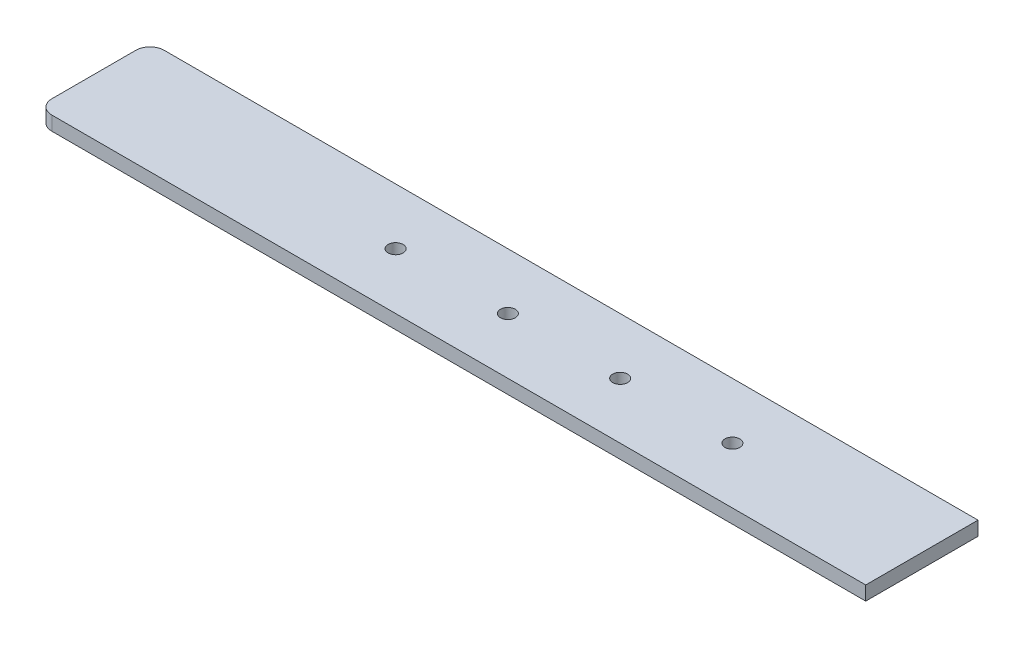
ISO-10303-21;
HEADER;
FILE_DESCRIPTION(('STEP AP214'),'2;1');
FILE_NAME('part.step','',(''),(''),'','','');
FILE_SCHEMA(('AUTOMOTIVE_DESIGN { 1 0 10303 214 1 1 1 1 }'));
ENDSEC;
DATA;
#1=APPLICATION_CONTEXT('core data for automotive mechanical design processes');
#2=APPLICATION_PROTOCOL_DEFINITION('international standard','automotive_design',2000,#1);
#3=PRODUCT_CONTEXT('',#1,'mechanical');
#4=PRODUCT('Part','Part','',(#3));
#5=PRODUCT_RELATED_PRODUCT_CATEGORY('part','',(#4));
#6=PRODUCT_DEFINITION_FORMATION('','',#4);
#7=PRODUCT_DEFINITION_CONTEXT('part definition',#1,'design');
#8=PRODUCT_DEFINITION('design','',#6,#7);
#9=PRODUCT_DEFINITION_SHAPE('','',#8);
#10=(LENGTH_UNIT() NAMED_UNIT(*) SI_UNIT(.MILLI.,.METRE.));
#11=(NAMED_UNIT(*) PLANE_ANGLE_UNIT() SI_UNIT($,.RADIAN.));
#12=(NAMED_UNIT(*) SI_UNIT($,.STERADIAN.) SOLID_ANGLE_UNIT());
#13=UNCERTAINTY_MEASURE_WITH_UNIT(LENGTH_MEASURE(1.E-05),#10,'distance_accuracy_value','');
#14=(GEOMETRIC_REPRESENTATION_CONTEXT(3) GLOBAL_UNCERTAINTY_ASSIGNED_CONTEXT((#13)) GLOBAL_UNIT_ASSIGNED_CONTEXT((#10,
#11,#12)) REPRESENTATION_CONTEXT('',''));
#15=CARTESIAN_POINT('',(0.,0.,0.));
#16=DIRECTION('',(0.,0.,1.));
#17=DIRECTION('',(1.,0.,0.));
#18=AXIS2_PLACEMENT_3D('',#15,#16,#17);
#19=CARTESIAN_POINT('',(-187.325,-6.35000000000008,25.4000000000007));
#20=DIRECTION('',(-1.00000000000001,0.,0.));
#21=DIRECTION('',(0.,0.,1.));
#22=AXIS2_PLACEMENT_3D('',#19,#20,#21);
#23=PLANE('',#22);
#24=DIRECTION('',(0.,0.,1.));
#25=VECTOR('',#24,1.);
#26=CARTESIAN_POINT('',(-187.325,0.,25.4));
#27=LINE('',#26,#25);
#28=CARTESIAN_POINT('',(-187.325,0.,-19.0499999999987));
#29=VERTEX_POINT('',#28);
#30=CARTESIAN_POINT('',(-187.325000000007,2.88657986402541E-12,19.05));
#31=VERTEX_POINT('',#30);
#32=EDGE_CURVE('E119',#29,#31,#27,.T.);
#33=ORIENTED_EDGE('',*,*,#32,.F.);
#34=DIRECTION('',(0.,1.,0.));
#35=VECTOR('',#34,1.);
#36=CARTESIAN_POINT('',(-187.325,-6.34999999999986,-19.0499999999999));
#37=LINE('',#36,#35);
#38=CARTESIAN_POINT('',(-187.325,-6.34999999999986,-19.0499999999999));
#39=VERTEX_POINT('',#38);
#40=EDGE_CURVE('E140',#29,#39,#37,.F.);
#41=ORIENTED_EDGE('',*,*,#40,.T.);
#42=DIRECTION('',(0.,0.,1.));
#43=VECTOR('',#42,1.);
#44=CARTESIAN_POINT('',(-187.325,-6.35000000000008,25.4000000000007));
#45=LINE('',#44,#43);
#46=CARTESIAN_POINT('',(-187.325000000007,-6.34999999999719,19.0500000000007));
#47=VERTEX_POINT('',#46);
#48=EDGE_CURVE('E102',#39,#47,#45,.T.);
#49=ORIENTED_EDGE('',*,*,#48,.T.);
#50=DIRECTION('',(0.,1.,0.));
#51=VECTOR('',#50,1.);
#52=CARTESIAN_POINT('',(-187.325000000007,-6.34999999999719,19.0500000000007));
#53=LINE('',#52,#51);
#54=EDGE_CURVE('E137',#47,#31,#53,.T.);
#55=ORIENTED_EDGE('',*,*,#54,.T.);
#56=EDGE_LOOP('',(#33,#41,#49,#55));
#57=FACE_BOUND('',#56,.T.);
#58=ADVANCED_FACE('F44',(#57),#23,.T.);
#59=CARTESIAN_POINT('',(-187.325,-6.35000000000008,-25.4));
#60=DIRECTION('',(0.,0.,-1.));
#61=DIRECTION('',(-1.00000000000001,0.,0.));
#62=AXIS2_PLACEMENT_3D('',#59,#60,#61);
#63=PLANE('',#62);
#64=DIRECTION('',(-1.00000000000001,0.,0.));
#65=VECTOR('',#64,1.);
#66=CARTESIAN_POINT('',(-187.325,-6.35000000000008,-25.4));
#67=LINE('',#66,#65);
#68=CARTESIAN_POINT('',(187.325000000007,-6.35000000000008,-25.4000000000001));
#69=VERTEX_POINT('',#68);
#70=CARTESIAN_POINT('',(-180.975,-6.35000000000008,-25.4));
#71=VERTEX_POINT('',#70);
#72=EDGE_CURVE('E111',#69,#71,#67,.T.);
#73=ORIENTED_EDGE('',*,*,#72,.T.);
#74=DIRECTION('',(0.,1.,0.));
#75=VECTOR('',#74,1.);
#76=CARTESIAN_POINT('',(-180.975,-6.35000000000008,-25.4));
#77=LINE('',#76,#75);
#78=CARTESIAN_POINT('',(-180.975,0.,-25.3999999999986));
#79=VERTEX_POINT('',#78);
#80=EDGE_CURVE('E129',#71,#79,#77,.T.);
#81=ORIENTED_EDGE('',*,*,#80,.T.);
#82=DIRECTION('',(-1.00000000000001,0.,0.));
#83=VECTOR('',#82,1.);
#84=CARTESIAN_POINT('',(-187.325,0.,-25.3999999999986));
#85=LINE('',#84,#83);
#86=CARTESIAN_POINT('',(187.325000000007,0.,-25.3999999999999));
#87=VERTEX_POINT('',#86);
#88=EDGE_CURVE('E126',#87,#79,#85,.T.);
#89=ORIENTED_EDGE('',*,*,#88,.F.);
#90=DIRECTION('',(0.,1.,0.));
#91=VECTOR('',#90,1.);
#92=CARTESIAN_POINT('',(187.325000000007,-6.35000000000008,-25.4000000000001));
#93=LINE('',#92,#91);
#94=EDGE_CURVE('E110',#69,#87,#93,.T.);
#95=ORIENTED_EDGE('',*,*,#94,.F.);
#96=EDGE_LOOP('',(#73,#81,#89,#95));
#97=FACE_BOUND('',#96,.T.);
#98=ADVANCED_FACE('F147',(#97),#63,.T.);
#99=CARTESIAN_POINT('',(187.325000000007,-6.35000000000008,25.4000000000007));
#100=DIRECTION('',(1.00000000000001,0.,0.));
#101=DIRECTION('',(0.,0.,-1.));
#102=AXIS2_PLACEMENT_3D('',#99,#100,#101);
#103=PLANE('',#102);
#104=DIRECTION('',(0.,0.,-1.));
#105=VECTOR('',#104,1.);
#106=CARTESIAN_POINT('',(187.325000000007,0.,25.4));
#107=LINE('',#106,#105);
#108=CARTESIAN_POINT('',(187.325000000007,0.,25.4));
#109=VERTEX_POINT('',#108);
#110=EDGE_CURVE('E109',#109,#87,#107,.T.);
#111=ORIENTED_EDGE('',*,*,#110,.F.);
#112=DIRECTION('',(0.,1.,0.));
#113=VECTOR('',#112,1.);
#114=CARTESIAN_POINT('',(187.325000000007,-6.35000000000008,25.4000000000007));
#115=LINE('',#114,#113);
#116=CARTESIAN_POINT('',(187.325000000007,-6.35000000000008,25.4000000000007));
#117=VERTEX_POINT('',#116);
#118=EDGE_CURVE('E98',#117,#109,#115,.T.);
#119=ORIENTED_EDGE('',*,*,#118,.F.);
#120=DIRECTION('',(0.,0.,-1.));
#121=VECTOR('',#120,1.);
#122=CARTESIAN_POINT('',(187.325000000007,-6.35000000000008,25.4000000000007));
#123=LINE('',#122,#121);
#124=EDGE_CURVE('E101',#117,#69,#123,.T.);
#125=ORIENTED_EDGE('',*,*,#124,.T.);
#126=ORIENTED_EDGE('',*,*,#94,.T.);
#127=EDGE_LOOP('',(#111,#119,#125,#126));
#128=FACE_BOUND('',#127,.T.);
#129=ADVANCED_FACE('F106',(#128),#103,.T.);
#130=CARTESIAN_POINT('',(-187.325,-6.35000000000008,25.4000000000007));
#131=DIRECTION('',(0.,0.,1.));
#132=DIRECTION('',(1.00000000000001,0.,0.));
#133=AXIS2_PLACEMENT_3D('',#130,#131,#132);
#134=PLANE('',#133);
#135=DIRECTION('',(1.00000000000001,0.,0.));
#136=VECTOR('',#135,1.);
#137=CARTESIAN_POINT('',(-187.325,0.,25.4));
#138=LINE('',#137,#136);
#139=CARTESIAN_POINT('',(-180.975,0.,25.4));
#140=VERTEX_POINT('',#139);
#141=EDGE_CURVE('E122',#140,#109,#138,.T.);
#142=ORIENTED_EDGE('',*,*,#141,.F.);
#143=DIRECTION('',(0.,1.,0.));
#144=VECTOR('',#143,1.);
#145=CARTESIAN_POINT('',(-180.975,-6.35000000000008,25.4000000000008));
#146=LINE('',#145,#144);
#147=CARTESIAN_POINT('',(-180.975,-6.35000000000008,25.4000000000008));
#148=VERTEX_POINT('',#147);
#149=EDGE_CURVE('E13',#140,#148,#146,.F.);
#150=ORIENTED_EDGE('',*,*,#149,.T.);
#151=DIRECTION('',(1.00000000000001,0.,0.));
#152=VECTOR('',#151,1.);
#153=CARTESIAN_POINT('',(-187.325,-6.35000000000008,25.4000000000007));
#154=LINE('',#153,#152);
#155=EDGE_CURVE('E95',#148,#117,#154,.T.);
#156=ORIENTED_EDGE('',*,*,#155,.T.);
#157=ORIENTED_EDGE('',*,*,#118,.T.);
#158=EDGE_LOOP('',(#142,#150,#156,#157));
#159=FACE_BOUND('',#158,.T.);
#160=ADVANCED_FACE('F97',(#159),#134,.T.);
#161=CARTESIAN_POINT('',(0.,-6.35000000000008,7.21644966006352E-13));
#162=DIRECTION('',(0.,-1.,0.));
#163=DIRECTION('',(0.,0.,-1.));
#164=AXIS2_PLACEMENT_3D('',#161,#162,#163);
#165=PLANE('',#164);
#166=CARTESIAN_POINT('',(101.6,-6.35000000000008,1.4432899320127E-12));
#167=DIRECTION('',(0.,1.,0.));
#168=DIRECTION('',(0.,0.,1.));
#169=AXIS2_PLACEMENT_3D('',#166,#167,#168);
#170=CIRCLE('',#169,3.36549999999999);
#171=CARTESIAN_POINT('',(101.6,-6.35000000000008,3.36550000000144));
#172=VERTEX_POINT('',#171);
#173=EDGE_CURVE('E197',#172,#172,#170,.T.);
#174=ORIENTED_EDGE('',*,*,#173,.T.);
#175=EDGE_LOOP('',(#174));
#176=FACE_BOUND('',#175,.T.);
#177=CARTESIAN_POINT('',(50.8,-6.35000000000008,7.21644966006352E-13));
#178=DIRECTION('',(0.,1.,0.));
#179=DIRECTION('',(0.,0.,1.));
#180=AXIS2_PLACEMENT_3D('',#177,#178,#179);
#181=CIRCLE('',#180,3.3655);
#182=CARTESIAN_POINT('',(50.8,-6.35000000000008,3.36550000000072));
#183=VERTEX_POINT('',#182);
#184=EDGE_CURVE('E205',#183,#183,#181,.T.);
#185=ORIENTED_EDGE('',*,*,#184,.T.);
#186=EDGE_LOOP('',(#185));
#187=FACE_BOUND('',#186,.T.);
#188=CARTESIAN_POINT('',(0.,-6.35000000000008,7.21644966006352E-13));
#189=DIRECTION('',(0.,1.,0.));
#190=DIRECTION('',(0.,0.,1.));
#191=AXIS2_PLACEMENT_3D('',#188,#189,#190);
#192=CIRCLE('',#191,3.36549999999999);
#193=CARTESIAN_POINT('',(0.,-6.35000000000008,3.36550000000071));
#194=VERTEX_POINT('',#193);
#195=EDGE_CURVE('E211',#194,#194,#192,.T.);
#196=ORIENTED_EDGE('',*,*,#195,.T.);
#197=EDGE_LOOP('',(#196));
#198=FACE_BOUND('',#197,.T.);
#199=CARTESIAN_POINT('',(-50.8,-6.35000000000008,1.4432899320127E-12));
#200=DIRECTION('',(0.,1.,0.));
#201=DIRECTION('',(0.,0.,1.));
#202=AXIS2_PLACEMENT_3D('',#199,#200,#201);
#203=CIRCLE('',#202,3.36549999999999);
#204=CARTESIAN_POINT('',(-50.8,-6.35000000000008,3.36550000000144));
#205=VERTEX_POINT('',#204);
#206=EDGE_CURVE('E123',#205,#205,#203,.T.);
#207=ORIENTED_EDGE('',*,*,#206,.T.);
#208=EDGE_LOOP('',(#207));
#209=FACE_BOUND('',#208,.T.);
#210=ORIENTED_EDGE('',*,*,#48,.F.);
#211=CARTESIAN_POINT('',(-180.975,-6.34999999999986,-19.0499999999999));
#212=DIRECTION('',(0.,-1.,0.));
#213=DIRECTION('',(0.,0.,-1.));
#214=AXIS2_PLACEMENT_3D('',#211,#212,#213);
#215=CIRCLE('',#214,6.35);
#216=EDGE_CURVE('E52',#39,#71,#215,.T.);
#217=ORIENTED_EDGE('',*,*,#216,.T.);
#218=ORIENTED_EDGE('',*,*,#72,.F.);
#219=ORIENTED_EDGE('',*,*,#124,.F.);
#220=ORIENTED_EDGE('',*,*,#155,.F.);
#221=CARTESIAN_POINT('',(-180.975000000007,-6.34999999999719,19.0500000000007));
#222=DIRECTION('',(0.,-1.,0.));
#223=DIRECTION('',(0.,0.,-1.));
#224=AXIS2_PLACEMENT_3D('',#221,#222,#223);
#225=CIRCLE('',#224,6.35);
#226=EDGE_CURVE('E64',#148,#47,#225,.T.);
#227=ORIENTED_EDGE('',*,*,#226,.T.);
#228=EDGE_LOOP('',(#210,#217,#218,#219,#220,#227));
#229=FACE_BOUND('',#228,.T.);
#230=ADVANCED_FACE('F113',(#176,#187,#198,#209,#229),#165,.T.);
#231=CARTESIAN_POINT('',(0.,0.,0.));
#232=DIRECTION('',(0.,-1.,0.));
#233=DIRECTION('',(0.,0.,-1.));
#234=AXIS2_PLACEMENT_3D('',#231,#232,#233);
#235=PLANE('',#234);
#236=CARTESIAN_POINT('',(101.6,0.,7.21644966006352E-13));
#237=DIRECTION('',(0.,1.,0.));
#238=DIRECTION('',(0.,0.,1.));
#239=AXIS2_PLACEMENT_3D('',#236,#237,#238);
#240=CIRCLE('',#239,3.36549999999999);
#241=CARTESIAN_POINT('',(101.6,0.,3.36550000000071));
#242=VERTEX_POINT('',#241);
#243=EDGE_CURVE('E200',#242,#242,#240,.T.);
#244=ORIENTED_EDGE('',*,*,#243,.F.);
#245=EDGE_LOOP('',(#244));
#246=FACE_BOUND('',#245,.T.);
#247=CARTESIAN_POINT('',(50.8,0.,0.));
#248=DIRECTION('',(0.,1.,0.));
#249=DIRECTION('',(0.,0.,1.));
#250=AXIS2_PLACEMENT_3D('',#247,#248,#249);
#251=CIRCLE('',#250,3.3655);
#252=CARTESIAN_POINT('',(50.8,0.,3.3655));
#253=VERTEX_POINT('',#252);
#254=EDGE_CURVE('E202',#253,#253,#251,.T.);
#255=ORIENTED_EDGE('',*,*,#254,.F.);
#256=EDGE_LOOP('',(#255));
#257=FACE_BOUND('',#256,.T.);
#258=CARTESIAN_POINT('',(0.,0.,0.));
#259=DIRECTION('',(0.,1.,0.));
#260=DIRECTION('',(0.,0.,1.));
#261=AXIS2_PLACEMENT_3D('',#258,#259,#260);
#262=CIRCLE('',#261,3.36549999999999);
#263=CARTESIAN_POINT('',(0.,0.,3.36549999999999));
#264=VERTEX_POINT('',#263);
#265=EDGE_CURVE('E208',#264,#264,#262,.T.);
#266=ORIENTED_EDGE('',*,*,#265,.F.);
#267=EDGE_LOOP('',(#266));
#268=FACE_BOUND('',#267,.T.);
#269=CARTESIAN_POINT('',(-50.8,0.,7.21644966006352E-13));
#270=DIRECTION('',(0.,1.,0.));
#271=DIRECTION('',(0.,0.,1.));
#272=AXIS2_PLACEMENT_3D('',#269,#270,#271);
#273=CIRCLE('',#272,3.36549999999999);
#274=CARTESIAN_POINT('',(-50.8,0.,3.36550000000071));
#275=VERTEX_POINT('',#274);
#276=EDGE_CURVE('E214',#275,#275,#273,.T.);
#277=ORIENTED_EDGE('',*,*,#276,.F.);
#278=EDGE_LOOP('',(#277));
#279=FACE_BOUND('',#278,.T.);
#280=ORIENTED_EDGE('',*,*,#88,.T.);
#281=CARTESIAN_POINT('',(-180.975,0.,-19.0499999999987));
#282=DIRECTION('',(0.,-1.,0.));
#283=DIRECTION('',(0.,0.,-1.));
#284=AXIS2_PLACEMENT_3D('',#281,#282,#283);
#285=CIRCLE('',#284,6.35);
#286=EDGE_CURVE('E135',#79,#29,#285,.F.);
#287=ORIENTED_EDGE('',*,*,#286,.T.);
#288=ORIENTED_EDGE('',*,*,#32,.T.);
#289=CARTESIAN_POINT('',(-180.975000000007,2.88657986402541E-12,19.05));
#290=DIRECTION('',(0.,-1.,0.));
#291=DIRECTION('',(0.,0.,-1.));
#292=AXIS2_PLACEMENT_3D('',#289,#290,#291);
#293=CIRCLE('',#292,6.35);
#294=EDGE_CURVE('E133',#31,#140,#293,.F.);
#295=ORIENTED_EDGE('',*,*,#294,.T.);
#296=ORIENTED_EDGE('',*,*,#141,.T.);
#297=ORIENTED_EDGE('',*,*,#110,.T.);
#298=EDGE_LOOP('',(#280,#287,#288,#295,#296,#297));
#299=FACE_BOUND('',#298,.T.);
#300=ADVANCED_FACE('F152',(#246,#257,#268,#279,#299),#235,.F.);
#301=CARTESIAN_POINT('',(-50.8,-6.35000000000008,1.4432899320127E-12));
#302=DIRECTION('',(0.,1.,0.));
#303=DIRECTION('',(0.,0.,1.));
#304=AXIS2_PLACEMENT_3D('',#301,#302,#303);
#305=CYLINDRICAL_SURFACE('',#304,3.36549999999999);
#306=ORIENTED_EDGE('',*,*,#206,.F.);
#307=EDGE_LOOP('',(#306));
#308=FACE_BOUND('',#307,.T.);
#309=ORIENTED_EDGE('',*,*,#276,.T.);
#310=EDGE_LOOP('',(#309));
#311=FACE_BOUND('',#310,.T.);
#312=ADVANCED_FACE('F174',(#308,#311),#305,.F.);
#313=CARTESIAN_POINT('',(0.,-6.35000000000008,7.21644966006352E-13));
#314=DIRECTION('',(0.,1.,0.));
#315=DIRECTION('',(0.,0.,1.));
#316=AXIS2_PLACEMENT_3D('',#313,#314,#315);
#317=CYLINDRICAL_SURFACE('',#316,3.36549999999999);
#318=ORIENTED_EDGE('',*,*,#195,.F.);
#319=EDGE_LOOP('',(#318));
#320=FACE_BOUND('',#319,.T.);
#321=ORIENTED_EDGE('',*,*,#265,.T.);
#322=EDGE_LOOP('',(#321));
#323=FACE_BOUND('',#322,.T.);
#324=ADVANCED_FACE('F181',(#320,#323),#317,.F.);
#325=CARTESIAN_POINT('',(50.8,-6.35000000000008,7.21644966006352E-13));
#326=DIRECTION('',(0.,1.,0.));
#327=DIRECTION('',(0.,0.,1.));
#328=AXIS2_PLACEMENT_3D('',#325,#326,#327);
#329=CYLINDRICAL_SURFACE('',#328,3.3655);
#330=ORIENTED_EDGE('',*,*,#184,.F.);
#331=EDGE_LOOP('',(#330));
#332=FACE_BOUND('',#331,.T.);
#333=ORIENTED_EDGE('',*,*,#254,.T.);
#334=EDGE_LOOP('',(#333));
#335=FACE_BOUND('',#334,.T.);
#336=ADVANCED_FACE('F185',(#332,#335),#329,.F.);
#337=CARTESIAN_POINT('',(101.6,-6.35000000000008,1.4432899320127E-12));
#338=DIRECTION('',(0.,1.,0.));
#339=DIRECTION('',(0.,0.,1.));
#340=AXIS2_PLACEMENT_3D('',#337,#338,#339);
#341=CYLINDRICAL_SURFACE('',#340,3.36549999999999);
#342=ORIENTED_EDGE('',*,*,#173,.F.);
#343=EDGE_LOOP('',(#342));
#344=FACE_BOUND('',#343,.T.);
#345=ORIENTED_EDGE('',*,*,#243,.T.);
#346=EDGE_LOOP('',(#345));
#347=FACE_BOUND('',#346,.T.);
#348=ADVANCED_FACE('F160',(#344,#347),#341,.F.);
#349=CARTESIAN_POINT('',(-180.975,-6.34999999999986,-19.0499999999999));
#350=DIRECTION('',(0.,1.,0.));
#351=DIRECTION('',(0.,0.,1.));
#352=AXIS2_PLACEMENT_3D('',#349,#350,#351);
#353=CYLINDRICAL_SURFACE('',#352,6.35);
#354=ORIENTED_EDGE('',*,*,#216,.F.);
#355=ORIENTED_EDGE('',*,*,#40,.F.);
#356=ORIENTED_EDGE('',*,*,#286,.F.);
#357=ORIENTED_EDGE('',*,*,#80,.F.);
#358=EDGE_LOOP('',(#354,#355,#356,#357));
#359=FACE_BOUND('',#358,.T.);
#360=ADVANCED_FACE('F149',(#359),#353,.T.);
#361=CARTESIAN_POINT('',(-180.975000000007,-6.34999999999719,19.0500000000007));
#362=DIRECTION('',(0.,1.,0.));
#363=DIRECTION('',(0.,0.,1.));
#364=AXIS2_PLACEMENT_3D('',#361,#362,#363);
#365=CYLINDRICAL_SURFACE('',#364,6.35);
#366=ORIENTED_EDGE('',*,*,#226,.F.);
#367=ORIENTED_EDGE('',*,*,#149,.F.);
#368=ORIENTED_EDGE('',*,*,#294,.F.);
#369=ORIENTED_EDGE('',*,*,#54,.F.);
#370=EDGE_LOOP('',(#366,#367,#368,#369));
#371=FACE_BOUND('',#370,.T.);
#372=ADVANCED_FACE('F46',(#371),#365,.T.);
#373=CLOSED_SHELL('',(#58,#98,#129,#160,#230,#300,#312,#324,#336,#348,#360,#372));
#374=MANIFOLD_SOLID_BREP('B2',#373);
#375=ADVANCED_BREP_SHAPE_REPRESENTATION('',(#18,#374),#14);
#376=SHAPE_DEFINITION_REPRESENTATION(#9,#375);
ENDSEC;
END-ISO-10303-21;
